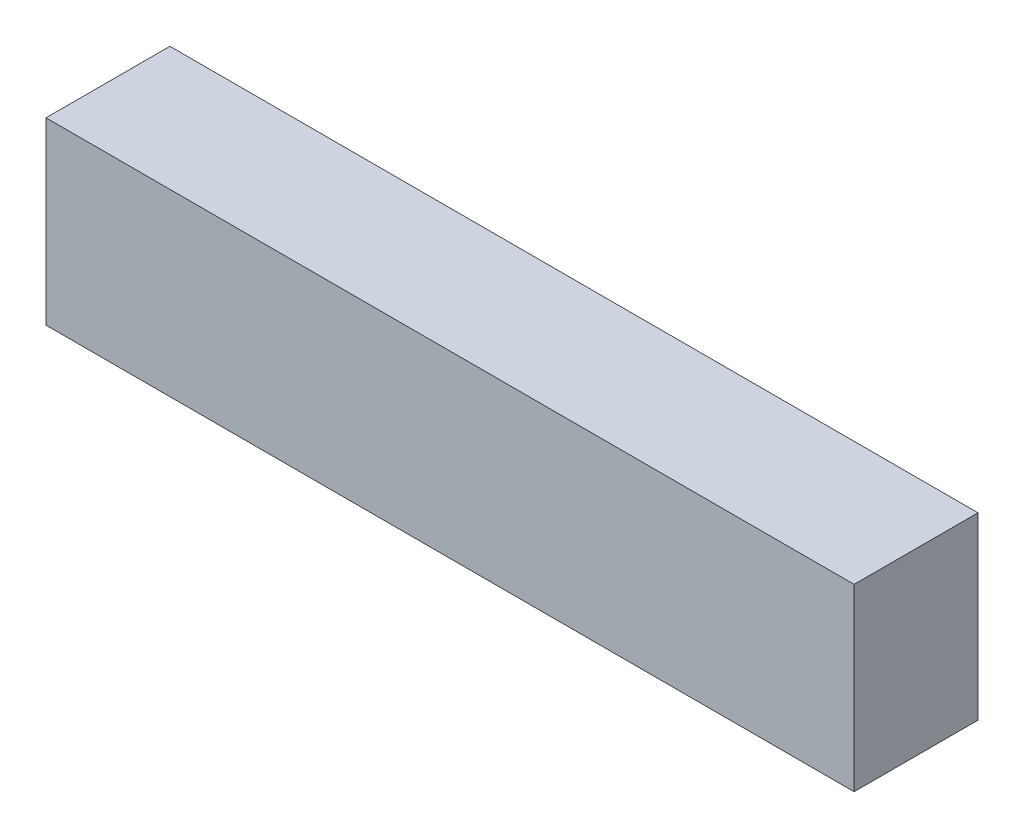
ISO-10303-21;
HEADER;
FILE_DESCRIPTION(('STEP AP214'),'2;1');
FILE_NAME('part.step','',(''),(''),'','','');
FILE_SCHEMA(('AUTOMOTIVE_DESIGN { 1 0 10303 214 1 1 1 1 }'));
ENDSEC;
DATA;
#1=APPLICATION_CONTEXT('core data for automotive mechanical design processes');
#2=APPLICATION_PROTOCOL_DEFINITION('international standard','automotive_design',2000,#1);
#3=PRODUCT_CONTEXT('',#1,'mechanical');
#4=PRODUCT('Part','Part','',(#3));
#5=PRODUCT_RELATED_PRODUCT_CATEGORY('part','',(#4));
#6=PRODUCT_DEFINITION_FORMATION('','',#4);
#7=PRODUCT_DEFINITION_CONTEXT('part definition',#1,'design');
#8=PRODUCT_DEFINITION('design','',#6,#7);
#9=PRODUCT_DEFINITION_SHAPE('','',#8);
#10=(LENGTH_UNIT() NAMED_UNIT(*) SI_UNIT(.MILLI.,.METRE.));
#11=(NAMED_UNIT(*) PLANE_ANGLE_UNIT() SI_UNIT($,.RADIAN.));
#12=(NAMED_UNIT(*) SI_UNIT($,.STERADIAN.) SOLID_ANGLE_UNIT());
#13=UNCERTAINTY_MEASURE_WITH_UNIT(LENGTH_MEASURE(1.E-05),#10,'distance_accuracy_value','');
#14=(GEOMETRIC_REPRESENTATION_CONTEXT(3) GLOBAL_UNCERTAINTY_ASSIGNED_CONTEXT((#13)) GLOBAL_UNIT_ASSIGNED_CONTEXT((#10,
#11,#12)) REPRESENTATION_CONTEXT('',''));
#15=CARTESIAN_POINT('',(0.,0.,0.));
#16=DIRECTION('',(0.,0.,1.));
#17=DIRECTION('',(1.,0.,0.));
#18=AXIS2_PLACEMENT_3D('',#15,#16,#17);
#19=CARTESIAN_POINT('',(0.,0.,8.763));
#20=DIRECTION('',(1.,0.,0.));
#21=DIRECTION('',(0.,0.,-1.));
#22=AXIS2_PLACEMENT_3D('',#19,#20,#21);
#23=PLANE('',#22);
#24=DIRECTION('',(0.,-1.,0.));
#25=VECTOR('',#24,1.);
#26=CARTESIAN_POINT('',(0.,0.,0.));
#27=LINE('',#26,#25);
#28=CARTESIAN_POINT('',(0.,12.7,0.));
#29=VERTEX_POINT('',#28);
#30=CARTESIAN_POINT('',(0.,0.,0.));
#31=VERTEX_POINT('',#30);
#32=EDGE_CURVE('E95',#29,#31,#27,.T.);
#33=ORIENTED_EDGE('',*,*,#32,.T.);
#34=DIRECTION('',(0.,0.,-1.));
#35=VECTOR('',#34,1.);
#36=CARTESIAN_POINT('',(0.,0.,8.763));
#37=LINE('',#36,#35);
#38=CARTESIAN_POINT('',(0.,0.,8.763));
#39=VERTEX_POINT('',#38);
#40=EDGE_CURVE('E11',#39,#31,#37,.T.);
#41=ORIENTED_EDGE('',*,*,#40,.F.);
#42=DIRECTION('',(0.,-1.,0.));
#43=VECTOR('',#42,1.);
#44=CARTESIAN_POINT('',(0.,0.,8.763));
#45=LINE('',#44,#43);
#46=CARTESIAN_POINT('',(0.,12.7,8.763));
#47=VERTEX_POINT('',#46);
#48=EDGE_CURVE('E83',#47,#39,#45,.T.);
#49=ORIENTED_EDGE('',*,*,#48,.F.);
#50=DIRECTION('',(0.,0.,-1.));
#51=VECTOR('',#50,1.);
#52=CARTESIAN_POINT('',(0.,12.7,8.763));
#53=LINE('',#52,#51);
#54=EDGE_CURVE('E91',#47,#29,#53,.T.);
#55=ORIENTED_EDGE('',*,*,#54,.T.);
#56=EDGE_LOOP('',(#33,#41,#49,#55));
#57=FACE_BOUND('',#56,.T.);
#58=ADVANCED_FACE('F32',(#57),#23,.F.);
#59=CARTESIAN_POINT('',(0.,0.,8.763));
#60=DIRECTION('',(0.,1.,0.));
#61=DIRECTION('',(0.,0.,1.));
#62=AXIS2_PLACEMENT_3D('',#59,#60,#61);
#63=PLANE('',#62);
#64=DIRECTION('',(1.,0.,0.));
#65=VECTOR('',#64,1.);
#66=CARTESIAN_POINT('',(0.,0.,0.));
#67=LINE('',#66,#65);
#68=CARTESIAN_POINT('',(57.15,0.,0.));
#69=VERTEX_POINT('',#68);
#70=EDGE_CURVE('E87',#31,#69,#67,.T.);
#71=ORIENTED_EDGE('',*,*,#70,.T.);
#72=DIRECTION('',(0.,0.,-1.));
#73=VECTOR('',#72,1.);
#74=CARTESIAN_POINT('',(57.15,0.,8.763));
#75=LINE('',#74,#73);
#76=CARTESIAN_POINT('',(57.15,0.,8.763));
#77=VERTEX_POINT('',#76);
#78=EDGE_CURVE('E40',#77,#69,#75,.T.);
#79=ORIENTED_EDGE('',*,*,#78,.F.);
#80=DIRECTION('',(1.,0.,0.));
#81=VECTOR('',#80,1.);
#82=CARTESIAN_POINT('',(0.,0.,8.763));
#83=LINE('',#82,#81);
#84=EDGE_CURVE('E78',#39,#77,#83,.T.);
#85=ORIENTED_EDGE('',*,*,#84,.F.);
#86=ORIENTED_EDGE('',*,*,#40,.T.);
#87=EDGE_LOOP('',(#71,#79,#85,#86));
#88=FACE_BOUND('',#87,.T.);
#89=ADVANCED_FACE('F86',(#88),#63,.F.);
#90=CARTESIAN_POINT('',(57.15,0.,8.763));
#91=DIRECTION('',(-1.,0.,0.));
#92=DIRECTION('',(0.,0.,1.));
#93=AXIS2_PLACEMENT_3D('',#90,#91,#92);
#94=PLANE('',#93);
#95=DIRECTION('',(0.,1.,0.));
#96=VECTOR('',#95,1.);
#97=CARTESIAN_POINT('',(57.15,0.,0.));
#98=LINE('',#97,#96);
#99=CARTESIAN_POINT('',(57.15,12.7,0.));
#100=VERTEX_POINT('',#99);
#101=EDGE_CURVE('E65',#69,#100,#98,.T.);
#102=ORIENTED_EDGE('',*,*,#101,.T.);
#103=DIRECTION('',(0.,0.,-1.));
#104=VECTOR('',#103,1.);
#105=CARTESIAN_POINT('',(57.15,12.7,8.763));
#106=LINE('',#105,#104);
#107=CARTESIAN_POINT('',(57.15,12.7,8.763));
#108=VERTEX_POINT('',#107);
#109=EDGE_CURVE('E88',#108,#100,#106,.T.);
#110=ORIENTED_EDGE('',*,*,#109,.F.);
#111=DIRECTION('',(0.,1.,0.));
#112=VECTOR('',#111,1.);
#113=CARTESIAN_POINT('',(57.15,0.,8.763));
#114=LINE('',#113,#112);
#115=EDGE_CURVE('E81',#77,#108,#114,.T.);
#116=ORIENTED_EDGE('',*,*,#115,.F.);
#117=ORIENTED_EDGE('',*,*,#78,.T.);
#118=EDGE_LOOP('',(#102,#110,#116,#117));
#119=FACE_BOUND('',#118,.T.);
#120=ADVANCED_FACE('F89',(#119),#94,.F.);
#121=CARTESIAN_POINT('',(0.,12.7,8.763));
#122=DIRECTION('',(0.,-1.,0.));
#123=DIRECTION('',(0.,0.,-1.));
#124=AXIS2_PLACEMENT_3D('',#121,#122,#123);
#125=PLANE('',#124);
#126=DIRECTION('',(-1.,0.,0.));
#127=VECTOR('',#126,1.);
#128=CARTESIAN_POINT('',(0.,12.7,0.));
#129=LINE('',#128,#127);
#130=EDGE_CURVE('E71',#100,#29,#129,.T.);
#131=ORIENTED_EDGE('',*,*,#130,.T.);
#132=ORIENTED_EDGE('',*,*,#54,.F.);
#133=DIRECTION('',(-1.,0.,0.));
#134=VECTOR('',#133,1.);
#135=CARTESIAN_POINT('',(0.,12.7,8.763));
#136=LINE('',#135,#134);
#137=EDGE_CURVE('E48',#108,#47,#136,.T.);
#138=ORIENTED_EDGE('',*,*,#137,.F.);
#139=ORIENTED_EDGE('',*,*,#109,.T.);
#140=EDGE_LOOP('',(#131,#132,#138,#139));
#141=FACE_BOUND('',#140,.T.);
#142=ADVANCED_FACE('F102',(#141),#125,.F.);
#143=CARTESIAN_POINT('',(0.,12.7,8.763));
#144=DIRECTION('',(0.,0.,-1.));
#145=DIRECTION('',(-1.,0.,0.));
#146=AXIS2_PLACEMENT_3D('',#143,#144,#145);
#147=PLANE('',#146);
#148=ORIENTED_EDGE('',*,*,#48,.T.);
#149=ORIENTED_EDGE('',*,*,#84,.T.);
#150=ORIENTED_EDGE('',*,*,#115,.T.);
#151=ORIENTED_EDGE('',*,*,#137,.T.);
#152=EDGE_LOOP('',(#148,#149,#150,#151));
#153=FACE_BOUND('',#152,.T.);
#154=ADVANCED_FACE('F79',(#153),#147,.F.);
#155=CARTESIAN_POINT('',(0.,12.7,0.));
#156=DIRECTION('',(0.,0.,-1.));
#157=DIRECTION('',(-1.,0.,0.));
#158=AXIS2_PLACEMENT_3D('',#155,#156,#157);
#159=PLANE('',#158);
#160=ORIENTED_EDGE('',*,*,#32,.F.);
#161=ORIENTED_EDGE('',*,*,#130,.F.);
#162=ORIENTED_EDGE('',*,*,#101,.F.);
#163=ORIENTED_EDGE('',*,*,#70,.F.);
#164=EDGE_LOOP('',(#160,#161,#162,#163));
#165=FACE_BOUND('',#164,.T.);
#166=ADVANCED_FACE('F105',(#165),#159,.T.);
#167=CLOSED_SHELL('',(#58,#89,#120,#142,#154,#166));
#168=MANIFOLD_SOLID_BREP('B2',#167);
#169=ADVANCED_BREP_SHAPE_REPRESENTATION('',(#18,#168),#14);
#170=SHAPE_DEFINITION_REPRESENTATION(#9,#169);
ENDSEC;
END-ISO-10303-21;
